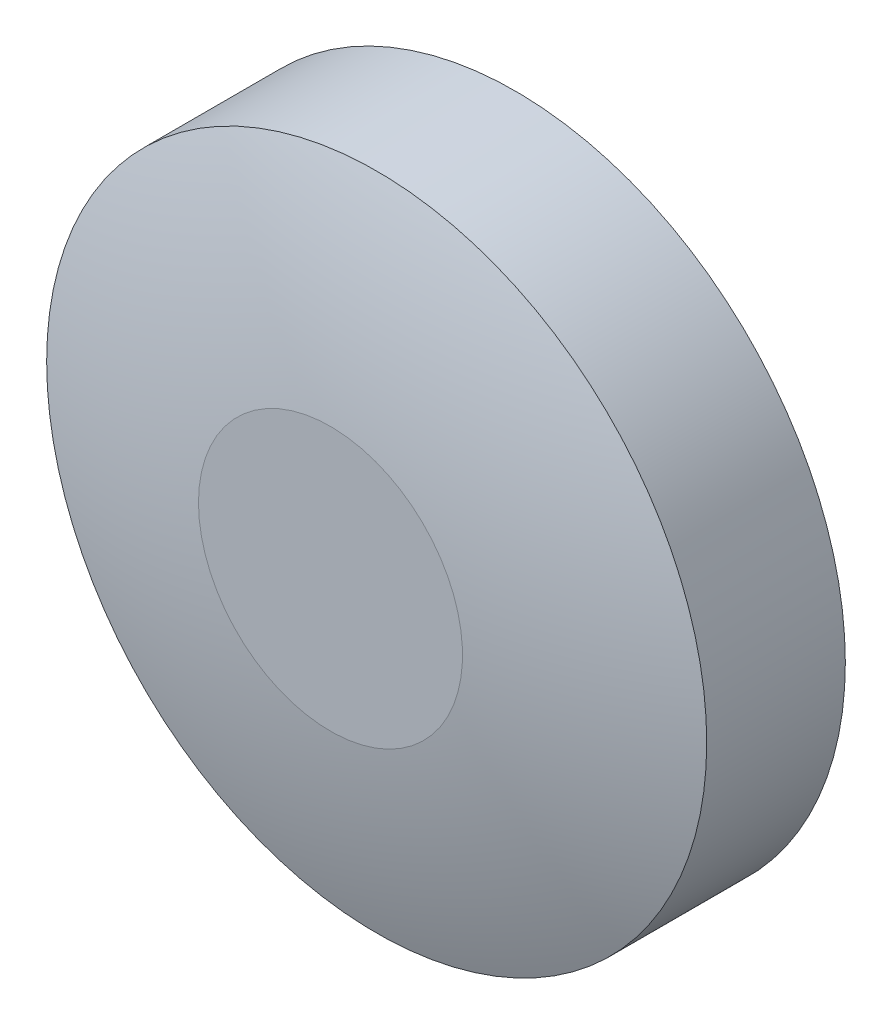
ISO-10303-21;
HEADER;
FILE_DESCRIPTION(('STEP AP214'),'2;1');
FILE_NAME('part.step','',(''),(''),'','','');
FILE_SCHEMA(('AUTOMOTIVE_DESIGN { 1 0 10303 214 1 1 1 1 }'));
ENDSEC;
DATA;
#1=APPLICATION_CONTEXT('core data for automotive mechanical design processes');
#2=APPLICATION_PROTOCOL_DEFINITION('international standard','automotive_design',2000,#1);
#3=PRODUCT_CONTEXT('',#1,'mechanical');
#4=PRODUCT('Part','Part','',(#3));
#5=PRODUCT_RELATED_PRODUCT_CATEGORY('part','',(#4));
#6=PRODUCT_DEFINITION_FORMATION('','',#4);
#7=PRODUCT_DEFINITION_CONTEXT('part definition',#1,'design');
#8=PRODUCT_DEFINITION('design','',#6,#7);
#9=PRODUCT_DEFINITION_SHAPE('','',#8);
#10=(LENGTH_UNIT() NAMED_UNIT(*) SI_UNIT(.MILLI.,.METRE.));
#11=(NAMED_UNIT(*) PLANE_ANGLE_UNIT() SI_UNIT($,.RADIAN.));
#12=(NAMED_UNIT(*) SI_UNIT($,.STERADIAN.) SOLID_ANGLE_UNIT());
#13=UNCERTAINTY_MEASURE_WITH_UNIT(LENGTH_MEASURE(1.E-05),#10,'distance_accuracy_value','');
#14=(GEOMETRIC_REPRESENTATION_CONTEXT(3) GLOBAL_UNCERTAINTY_ASSIGNED_CONTEXT((#13)) GLOBAL_UNIT_ASSIGNED_CONTEXT((#10,
#11,#12)) REPRESENTATION_CONTEXT('',''));
#15=CARTESIAN_POINT('',(0.,0.,0.));
#16=DIRECTION('',(0.,0.,1.));
#17=DIRECTION('',(1.,0.,0.));
#18=AXIS2_PLACEMENT_3D('',#15,#16,#17);
#19=CARTESIAN_POINT('',(0.,4.94243974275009,13.));
#20=DIRECTION('',(0.,0.,-1.));
#21=DIRECTION('',(-1.,0.,0.));
#22=AXIS2_PLACEMENT_3D('',#19,#20,#21);
#23=PLANE('',#22);
#24=CARTESIAN_POINT('',(0.,0.,13.));
#25=DIRECTION('',(0.,0.,-1.));
#26=DIRECTION('',(-1.,0.,0.));
#27=AXIS2_PLACEMENT_3D('',#24,#25,#26);
#28=CIRCLE('',#27,9.88487948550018);
#29=CARTESIAN_POINT('',(-9.88487948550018,0.,13.));
#30=VERTEX_POINT('',#29);
#31=EDGE_CURVE('E15',#30,#30,#28,.T.);
#32=ORIENTED_EDGE('',*,*,#31,.T.);
#33=EDGE_LOOP('',(#32));
#34=FACE_BOUND('',#33,.T.);
#35=ADVANCED_FACE('F12',(#34),#23,.T.);
#36=CARTESIAN_POINT('',(0.,0.,9.70647187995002));
#37=DIRECTION('',(0.,0.,-1.));
#38=DIRECTION('',(-1.,0.,0.));
#39=AXIS2_PLACEMENT_3D('',#36,#37,#38);
#40=CONICAL_SURFACE('',#39,24.,1.3415643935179);
#41=ORIENTED_EDGE('',*,*,#31,.F.);
#42=EDGE_LOOP('',(#41));
#43=FACE_BOUND('',#42,.T.);
#44=CARTESIAN_POINT('',(0.,0.,9.70647187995));
#45=DIRECTION('',(0.,0.,1.));
#46=DIRECTION('',(1.,0.,0.));
#47=AXIS2_PLACEMENT_3D('',#44,#45,#46);
#48=CIRCLE('',#47,24.);
#49=CARTESIAN_POINT('',(24.,0.,9.70647187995));
#50=VERTEX_POINT('',#49);
#51=EDGE_CURVE('E29',#50,#50,#48,.F.);
#52=ORIENTED_EDGE('',*,*,#51,.T.);
#53=EDGE_LOOP('',(#52));
#54=FACE_BOUND('',#53,.T.);
#55=ADVANCED_FACE('F41',(#43,#54),#40,.F.);
#56=CARTESIAN_POINT('',(0.,0.,4.853235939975));
#57=DIRECTION('',(0.,0.,1.));
#58=DIRECTION('',(1.,0.,0.));
#59=AXIS2_PLACEMENT_3D('',#56,#57,#58);
#60=CYLINDRICAL_SURFACE('',#59,24.);
#61=ORIENTED_EDGE('',*,*,#51,.F.);
#62=EDGE_LOOP('',(#61));
#63=FACE_BOUND('',#62,.T.);
#64=CARTESIAN_POINT('',(0.,0.,0.));
#65=DIRECTION('',(0.,0.,1.));
#66=DIRECTION('',(1.,0.,0.));
#67=AXIS2_PLACEMENT_3D('',#64,#65,#66);
#68=CIRCLE('',#67,24.);
#69=CARTESIAN_POINT('',(24.,0.,0.));
#70=VERTEX_POINT('',#69);
#71=EDGE_CURVE('E31',#70,#70,#68,.T.);
#72=ORIENTED_EDGE('',*,*,#71,.F.);
#73=EDGE_LOOP('',(#72));
#74=FACE_BOUND('',#73,.T.);
#75=ADVANCED_FACE('F39',(#63,#74),#60,.F.);
#76=CARTESIAN_POINT('',(0.,24.5,0.));
#77=DIRECTION('',(0.,0.,-1.));
#78=DIRECTION('',(-1.,0.,0.));
#79=AXIS2_PLACEMENT_3D('',#76,#77,#78);
#80=PLANE('',#79);
#81=CARTESIAN_POINT('',(0.,0.,0.));
#82=DIRECTION('',(0.,0.,1.));
#83=DIRECTION('',(1.,0.,0.));
#84=AXIS2_PLACEMENT_3D('',#81,#82,#83);
#85=CIRCLE('',#84,25.);
#86=CARTESIAN_POINT('',(25.,0.,0.));
#87=VERTEX_POINT('',#86);
#88=EDGE_CURVE('E24',#87,#87,#85,.T.);
#89=ORIENTED_EDGE('',*,*,#88,.F.);
#90=EDGE_LOOP('',(#89));
#91=FACE_BOUND('',#90,.T.);
#92=ORIENTED_EDGE('',*,*,#71,.T.);
#93=EDGE_LOOP('',(#92));
#94=FACE_BOUND('',#93,.T.);
#95=ADVANCED_FACE('F37',(#91,#94),#80,.T.);
#96=CARTESIAN_POINT('',(0.,5.,14.));
#97=DIRECTION('',(0.,0.,1.));
#98=DIRECTION('',(0.,1.,0.));
#99=AXIS2_PLACEMENT_3D('',#96,#97,#98);
#100=PLANE('',#99);
#101=CARTESIAN_POINT('',(0.,0.,14.));
#102=DIRECTION('',(0.,0.,-1.));
#103=DIRECTION('',(-1.,0.,0.));
#104=AXIS2_PLACEMENT_3D('',#101,#102,#103);
#105=CIRCLE('',#104,9.9999999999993);
#106=CARTESIAN_POINT('',(-9.9999999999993,0.,14.));
#107=VERTEX_POINT('',#106);
#108=EDGE_CURVE('E19',#107,#107,#105,.T.);
#109=ORIENTED_EDGE('',*,*,#108,.F.);
#110=EDGE_LOOP('',(#109));
#111=FACE_BOUND('',#110,.T.);
#112=ADVANCED_FACE('F50',(#111),#100,.T.);
#113=CARTESIAN_POINT('',(0.,0.,5.25));
#114=DIRECTION('',(0.,0.,1.));
#115=DIRECTION('',(1.,0.,0.));
#116=AXIS2_PLACEMENT_3D('',#113,#114,#115);
#117=CYLINDRICAL_SURFACE('',#116,25.);
#118=ORIENTED_EDGE('',*,*,#88,.T.);
#119=EDGE_LOOP('',(#118));
#120=FACE_BOUND('',#119,.T.);
#121=CARTESIAN_POINT('',(0.,0.,10.5));
#122=DIRECTION('',(0.,0.,-1.));
#123=DIRECTION('',(-1.,0.,0.));
#124=AXIS2_PLACEMENT_3D('',#121,#122,#123);
#125=CIRCLE('',#124,25.);
#126=CARTESIAN_POINT('',(-25.,0.,10.5));
#127=VERTEX_POINT('',#126);
#128=EDGE_CURVE('E8',#127,#127,#125,.F.);
#129=ORIENTED_EDGE('',*,*,#128,.F.);
#130=EDGE_LOOP('',(#129));
#131=FACE_BOUND('',#130,.T.);
#132=ADVANCED_FACE('F57',(#120,#131),#117,.T.);
#133=CARTESIAN_POINT('',(-1.69048826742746,0.,-55.5050502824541));
#134=DIRECTION('',(0.,1.,0.));
#135=DIRECTION('',(-1.,0.,0.));
#136=AXIS2_PLACEMENT_3D('',#133,#134,#135);
#137=CIRCLE('',#136,70.0000000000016);
#138=TRIMMED_CURVE('',#137,(PARAMETER_VALUE(-1.59494850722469)),
(PARAMETER_VALUE(1.59494850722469)),.T.,.PARAMETER.);
#139=CARTESIAN_POINT('',(0.,0.,-55.5050502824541));
#140=DIRECTION('',(0.,0.,-1.));
#141=AXIS1_PLACEMENT('',#139,#140);
#142=SURFACE_OF_REVOLUTION('',#138,#141);
#143=ORIENTED_EDGE('',*,*,#108,.T.);
#144=EDGE_LOOP('',(#143));
#145=FACE_BOUND('',#144,.T.);
#146=ORIENTED_EDGE('',*,*,#128,.T.);
#147=EDGE_LOOP('',(#146));
#148=FACE_BOUND('',#147,.T.);
#149=ADVANCED_FACE('F55',(#145,#148),#142,.F.);
#150=CLOSED_SHELL('',(#35,#55,#75,#95,#112,#132,#149));
#151=MANIFOLD_SOLID_BREP('B1',#150);
#152=ADVANCED_BREP_SHAPE_REPRESENTATION('',(#18,#151),#14);
#153=SHAPE_DEFINITION_REPRESENTATION(#9,#152);
ENDSEC;
END-ISO-10303-21;
